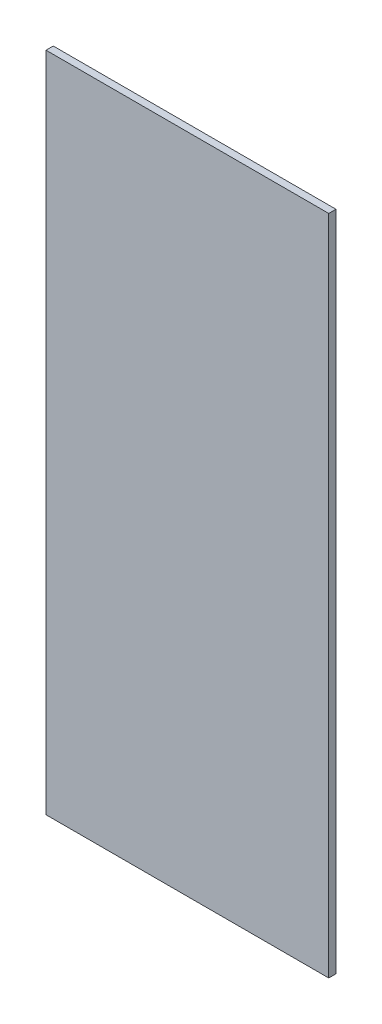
ISO-10303-21;
HEADER;
FILE_DESCRIPTION(('STEP AP214'),'2;1');
FILE_NAME('part.step','',(''),(''),'','','');
FILE_SCHEMA(('AUTOMOTIVE_DESIGN { 1 0 10303 214 1 1 1 1 }'));
ENDSEC;
DATA;
#1=APPLICATION_CONTEXT('core data for automotive mechanical design processes');
#2=APPLICATION_PROTOCOL_DEFINITION('international standard','automotive_design',2000,#1);
#3=PRODUCT_CONTEXT('',#1,'mechanical');
#4=PRODUCT('Part','Part','',(#3));
#5=PRODUCT_RELATED_PRODUCT_CATEGORY('part','',(#4));
#6=PRODUCT_DEFINITION_FORMATION('','',#4);
#7=PRODUCT_DEFINITION_CONTEXT('part definition',#1,'design');
#8=PRODUCT_DEFINITION('design','',#6,#7);
#9=PRODUCT_DEFINITION_SHAPE('','',#8);
#10=(LENGTH_UNIT() NAMED_UNIT(*) SI_UNIT(.MILLI.,.METRE.));
#11=(NAMED_UNIT(*) PLANE_ANGLE_UNIT() SI_UNIT($,.RADIAN.));
#12=(NAMED_UNIT(*) SI_UNIT($,.STERADIAN.) SOLID_ANGLE_UNIT());
#13=UNCERTAINTY_MEASURE_WITH_UNIT(LENGTH_MEASURE(1.E-05),#10,'distance_accuracy_value','');
#14=(GEOMETRIC_REPRESENTATION_CONTEXT(3) GLOBAL_UNCERTAINTY_ASSIGNED_CONTEXT((#13)) GLOBAL_UNIT_ASSIGNED_CONTEXT((#10,
#11,#12)) REPRESENTATION_CONTEXT('',''));
#15=CARTESIAN_POINT('',(0.,0.,0.));
#16=DIRECTION('',(0.,0.,1.));
#17=DIRECTION('',(1.,0.,0.));
#18=AXIS2_PLACEMENT_3D('',#15,#16,#17);
#19=CARTESIAN_POINT('',(292.5,685.,15.));
#20=DIRECTION('',(-1.,0.,0.));
#21=DIRECTION('',(0.,-1.,0.));
#22=AXIS2_PLACEMENT_3D('',#19,#20,#21);
#23=PLANE('',#22);
#24=DIRECTION('',(0.,1.,0.));
#25=VECTOR('',#24,1.);
#26=CARTESIAN_POINT('',(292.5,685.,0.));
#27=LINE('',#26,#25);
#28=CARTESIAN_POINT('',(292.5,-685.,0.));
#29=VERTEX_POINT('',#28);
#30=CARTESIAN_POINT('',(292.5,685.,0.));
#31=VERTEX_POINT('',#30);
#32=EDGE_CURVE('E111',#29,#31,#27,.T.);
#33=ORIENTED_EDGE('',*,*,#32,.T.);
#34=DIRECTION('',(0.,0.,-1.));
#35=VECTOR('',#34,1.);
#36=CARTESIAN_POINT('',(292.5,685.,15.));
#37=LINE('',#36,#35);
#38=CARTESIAN_POINT('',(292.5,685.,15.));
#39=VERTEX_POINT('',#38);
#40=EDGE_CURVE('E11',#39,#31,#37,.T.);
#41=ORIENTED_EDGE('',*,*,#40,.F.);
#42=DIRECTION('',(0.,1.,0.));
#43=VECTOR('',#42,1.);
#44=CARTESIAN_POINT('',(292.5,685.,15.));
#45=LINE('',#44,#43);
#46=CARTESIAN_POINT('',(292.5,-685.,15.));
#47=VERTEX_POINT('',#46);
#48=EDGE_CURVE('E95',#47,#39,#45,.T.);
#49=ORIENTED_EDGE('',*,*,#48,.F.);
#50=DIRECTION('',(0.,0.,-1.));
#51=VECTOR('',#50,1.);
#52=CARTESIAN_POINT('',(292.5,-685.,15.));
#53=LINE('',#52,#51);
#54=EDGE_CURVE('E107',#47,#29,#53,.T.);
#55=ORIENTED_EDGE('',*,*,#54,.T.);
#56=EDGE_LOOP('',(#33,#41,#49,#55));
#57=FACE_BOUND('',#56,.T.);
#58=ADVANCED_FACE('F43',(#57),#23,.F.);
#59=CARTESIAN_POINT('',(-292.5,685.,15.));
#60=DIRECTION('',(0.,-1.,0.));
#61=DIRECTION('',(0.,0.,-1.));
#62=AXIS2_PLACEMENT_3D('',#59,#60,#61);
#63=PLANE('',#62);
#64=DIRECTION('',(-1.,0.,0.));
#65=VECTOR('',#64,1.);
#66=CARTESIAN_POINT('',(-292.5,685.,0.));
#67=LINE('',#66,#65);
#68=CARTESIAN_POINT('',(-292.5,685.,0.));
#69=VERTEX_POINT('',#68);
#70=EDGE_CURVE('E100',#31,#69,#67,.T.);
#71=ORIENTED_EDGE('',*,*,#70,.T.);
#72=DIRECTION('',(0.,0.,-1.));
#73=VECTOR('',#72,1.);
#74=CARTESIAN_POINT('',(-292.5,685.,15.));
#75=LINE('',#74,#73);
#76=CARTESIAN_POINT('',(-292.5,685.,15.));
#77=VERTEX_POINT('',#76);
#78=EDGE_CURVE('E52',#77,#69,#75,.T.);
#79=ORIENTED_EDGE('',*,*,#78,.F.);
#80=DIRECTION('',(-1.,0.,0.));
#81=VECTOR('',#80,1.);
#82=CARTESIAN_POINT('',(-292.5,685.,15.));
#83=LINE('',#82,#81);
#84=EDGE_CURVE('E90',#39,#77,#83,.T.);
#85=ORIENTED_EDGE('',*,*,#84,.F.);
#86=ORIENTED_EDGE('',*,*,#40,.T.);
#87=EDGE_LOOP('',(#71,#79,#85,#86));
#88=FACE_BOUND('',#87,.T.);
#89=ADVANCED_FACE('F99',(#88),#63,.F.);
#90=CARTESIAN_POINT('',(-292.5,685.,15.));
#91=DIRECTION('',(1.,0.,0.));
#92=DIRECTION('',(0.,1.,0.));
#93=AXIS2_PLACEMENT_3D('',#90,#91,#92);
#94=PLANE('',#93);
#95=DIRECTION('',(0.,-1.,0.));
#96=VECTOR('',#95,1.);
#97=CARTESIAN_POINT('',(-292.5,685.,0.));
#98=LINE('',#97,#96);
#99=CARTESIAN_POINT('',(-292.5,-685.,0.));
#100=VERTEX_POINT('',#99);
#101=EDGE_CURVE('E77',#69,#100,#98,.T.);
#102=ORIENTED_EDGE('',*,*,#101,.T.);
#103=DIRECTION('',(0.,0.,-1.));
#104=VECTOR('',#103,1.);
#105=CARTESIAN_POINT('',(-292.5,-685.,15.));
#106=LINE('',#105,#104);
#107=CARTESIAN_POINT('',(-292.5,-685.,15.));
#108=VERTEX_POINT('',#107);
#109=EDGE_CURVE('E102',#108,#100,#106,.T.);
#110=ORIENTED_EDGE('',*,*,#109,.F.);
#111=DIRECTION('',(0.,-1.,0.));
#112=VECTOR('',#111,1.);
#113=CARTESIAN_POINT('',(-292.5,685.,15.));
#114=LINE('',#113,#112);
#115=EDGE_CURVE('E93',#77,#108,#114,.T.);
#116=ORIENTED_EDGE('',*,*,#115,.F.);
#117=ORIENTED_EDGE('',*,*,#78,.T.);
#118=EDGE_LOOP('',(#102,#110,#116,#117));
#119=FACE_BOUND('',#118,.T.);
#120=ADVANCED_FACE('F103',(#119),#94,.F.);
#121=CARTESIAN_POINT('',(-292.5,-685.,15.));
#122=DIRECTION('',(0.,1.,0.));
#123=DIRECTION('',(0.,0.,1.));
#124=AXIS2_PLACEMENT_3D('',#121,#122,#123);
#125=PLANE('',#124);
#126=DIRECTION('',(1.,0.,0.));
#127=VECTOR('',#126,1.);
#128=CARTESIAN_POINT('',(-292.5,-685.,0.));
#129=LINE('',#128,#127);
#130=EDGE_CURVE('E83',#100,#29,#129,.T.);
#131=ORIENTED_EDGE('',*,*,#130,.T.);
#132=ORIENTED_EDGE('',*,*,#54,.F.);
#133=DIRECTION('',(1.,0.,0.));
#134=VECTOR('',#133,1.);
#135=CARTESIAN_POINT('',(-292.5,-685.,15.));
#136=LINE('',#135,#134);
#137=EDGE_CURVE('E60',#108,#47,#136,.T.);
#138=ORIENTED_EDGE('',*,*,#137,.F.);
#139=ORIENTED_EDGE('',*,*,#109,.T.);
#140=EDGE_LOOP('',(#131,#132,#138,#139));
#141=FACE_BOUND('',#140,.T.);
#142=ADVANCED_FACE('F124',(#141),#125,.F.);
#143=CARTESIAN_POINT('',(0.,0.,15.));
#144=DIRECTION('',(0.,0.,1.));
#145=DIRECTION('',(1.,0.,0.));
#146=AXIS2_PLACEMENT_3D('',#143,#144,#145);
#147=PLANE('',#146);
#148=ORIENTED_EDGE('',*,*,#48,.T.);
#149=ORIENTED_EDGE('',*,*,#84,.T.);
#150=ORIENTED_EDGE('',*,*,#115,.T.);
#151=ORIENTED_EDGE('',*,*,#137,.T.);
#152=EDGE_LOOP('',(#148,#149,#150,#151));
#153=FACE_BOUND('',#152,.T.);
#154=ADVANCED_FACE('F91',(#153),#147,.T.);
#155=CARTESIAN_POINT('',(0.,0.,0.));
#156=DIRECTION('',(0.,0.,1.));
#157=DIRECTION('',(1.,0.,0.));
#158=AXIS2_PLACEMENT_3D('',#155,#156,#157);
#159=PLANE('',#158);
#160=ORIENTED_EDGE('',*,*,#32,.F.);
#161=ORIENTED_EDGE('',*,*,#130,.F.);
#162=ORIENTED_EDGE('',*,*,#101,.F.);
#163=ORIENTED_EDGE('',*,*,#70,.F.);
#164=EDGE_LOOP('',(#160,#161,#162,#163));
#165=FACE_BOUND('',#164,.T.);
#166=ADVANCED_FACE('F127',(#165),#159,.F.);
#167=CLOSED_SHELL('',(#58,#89,#120,#142,#154,#166));
#168=MANIFOLD_SOLID_BREP('B2',#167);
#169=ADVANCED_BREP_SHAPE_REPRESENTATION('',(#18,#168),#14);
#170=SHAPE_DEFINITION_REPRESENTATION(#9,#169);
ENDSEC;
END-ISO-10303-21;
